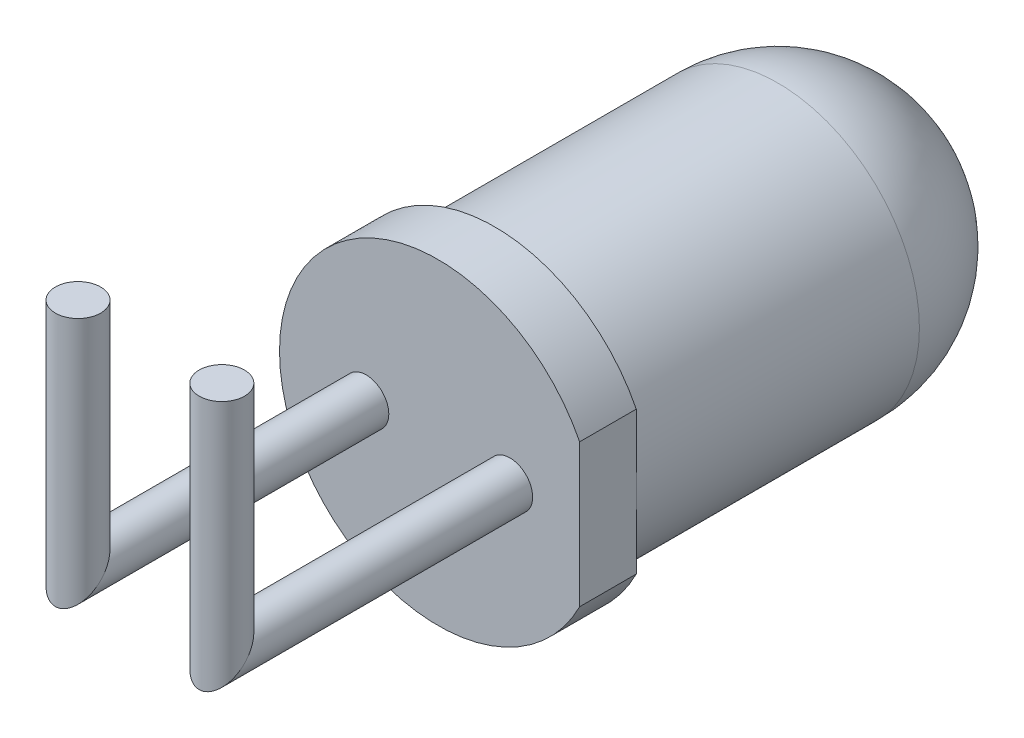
from build123d import *

# Parameters (mm, degrees)
ESQUISSE1_R          = 2.5
BASE_EXTRUSION_DEPTH = 8.5
BOSS_EXTRU_1_DEPTH   = 1
CONG_1_R             = 2.5
ESQUISSE3_R          = 0.4


with BuildPart() as part:
    # Esquisse1 → Base-Extrusion (new body)
    with BuildSketch(Plane.XY):
        Circle(ESQUISSE1_R)
    extrude(amount=BASE_EXTRUSION_DEPTH)

    # Esquisse2 → Boss.-Extru.1 (add)
    with BuildSketch(Plane.XY.offset(8.5)):
        with BuildLine():
            Line((2.5, 1.260952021), (2.5, -1.260952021))
            ThreePointArc((2.5, -1.260952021), (-2.8, 0), (2.5, 1.260952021))
        make_face()
    extrude(amount=-BOSS_EXTRU_1_DEPTH)

    # Cong_1
    cong_1_edges = [part.edges().sort_by_distance(p)[0] for p in [
        (-2.5, 0, 0),
    ]]
    fillet(cong_1_edges, radius=CONG_1_R)

    # Balayage1: sweep along a path in Esquisse4
    with BuildLine(Plane(origin=(0, 0, 0), x_dir=(0, 0, -1), z_dir=(1, 0, 0))) as balayage1_path:
        Line((-8.5, 0.088362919), (-13.5, 0.088362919))
        Line((-13.5, 0.088362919), (-13.5, 4.088362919))
    # Esquisse3 → Balayage1 (sweep)
    with BuildSketch(Plane.XY.offset(8.5)):
        with Locations((-1.27, 0)):
            Circle(ESQUISSE3_R)
        with Locations((1.27, 0)):
            Circle(ESQUISSE3_R)
    sweep(path=balayage1_path.line, transition=Transition.RIGHT)


solid = part.part
